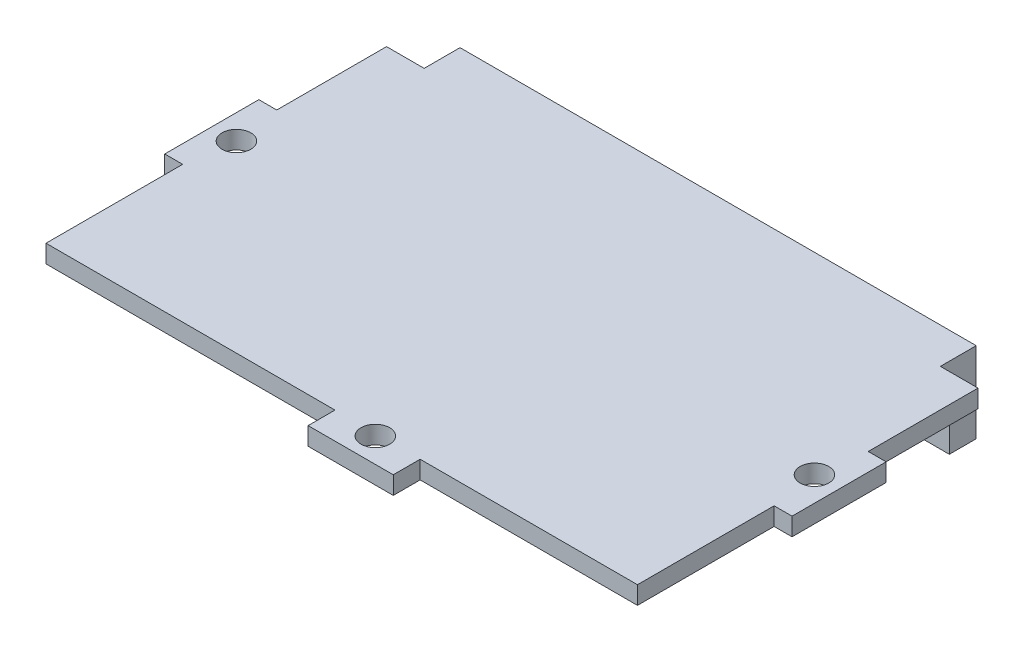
from build123d import *

# Parameters (mm, degrees)
SKETCH1_W           = 66
SKETCH1_H           = 42
BOSS_EXTRUDE1_DEPTH = 2
SKETCH2_W           = 4.2
SKETCH2_H           = 4
CUT_EXTRUDE1_DEPTH  = 40.166312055
SKETCH3_W           = 57.6
SKETCH3_H           = 7
BOSS_EXTRUDE2_DEPTH = 3
SKETCH5_R           = 1.6
SKETCH5_W           = 9.5
SKETCH5_H           = 16.25
BOSS_EXTRUDE3_DEPTH = 2
SKETCH6_R           = 1.6
CUT_EXTRUDE2_DEPTH  = 44.011626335


with BuildPart() as part:
    # Sketch1 → Boss-Extrude1 (new body)
    with BuildSketch(Plane(origin=(0, 0, 0), x_dir=(1, 0, 0), z_dir=(0, 1, 0))):
        Rectangle(SKETCH1_W, SKETCH1_H)
    extrude(amount=BOSS_EXTRUDE1_DEPTH)

    # Sketch2 → Cut-Extrude1 (cut, through all)
    with BuildSketch(Plane(origin=(0, 2, 0), x_dir=(1, 0, 0), z_dir=(0, 1, 0))):
        with Locations((-30.9, 19)):
            Rectangle(SKETCH2_W, SKETCH2_H)
        with Locations((30.9, 19)):
            Rectangle(SKETCH2_W, SKETCH2_H)
    extrude(amount=-CUT_EXTRUDE1_DEPTH, mode=Mode.SUBTRACT)

    # Sketch3 → Boss-Extrude2 (add)
    with BuildSketch(Plane(origin=(0, 0, -21), x_dir=(-1, 0, 0), z_dir=(0, 0, -1))):
        with Locations((0, -3.5)):
            Rectangle(SKETCH3_W, SKETCH3_H)
    extrude(amount=-BOSS_EXTRUDE2_DEPTH)

    # Sketch5 → Boss-Extrude3 (add)
    # profile 1 of 2: a face of its own
    with BuildSketch(Plane.XZ):
        Polygon((35, -4.75), (33, -4.75), (-33, -4.75), (-35, -4.75), (-35, 5.75), (-33, 5.75), (33, 5.75), (35, 5.75), align=None)
        with Locations((32.25, 0.5)):
            Circle(SKETCH5_R, mode=Mode.SUBTRACT)
        with Locations((-32.25, 0.5)):
            Circle(SKETCH5_R, mode=Mode.SUBTRACT)
    # profile 2 of 2: a face of its own
    with BuildSketch(Plane.XZ):
        with Locations((4, 15.875)):
            Rectangle(SKETCH5_W, SKETCH5_H)
        with Locations((4, 21.25)):
            Circle(SKETCH5_R, mode=Mode.SUBTRACT)
    extrude(amount=-BOSS_EXTRUDE3_DEPTH)

    # Sketch6 → Cut-Extrude2 (cut, through all)
    with BuildSketch(Plane.XZ):
        with Locations(Location((32.25, 0.5, 0), (0, 0, 270))):
            Circle(SKETCH6_R)
        with Locations(Location((-32.25, 0.5, 0), (0, 0, 90))):
            Circle(SKETCH6_R)
        with Locations(Location((4, 21.25, 0), (0, 0, 270))):
            Circle(SKETCH6_R)
    extrude(amount=-CUT_EXTRUDE2_DEPTH, mode=Mode.SUBTRACT)


solid = part.part
